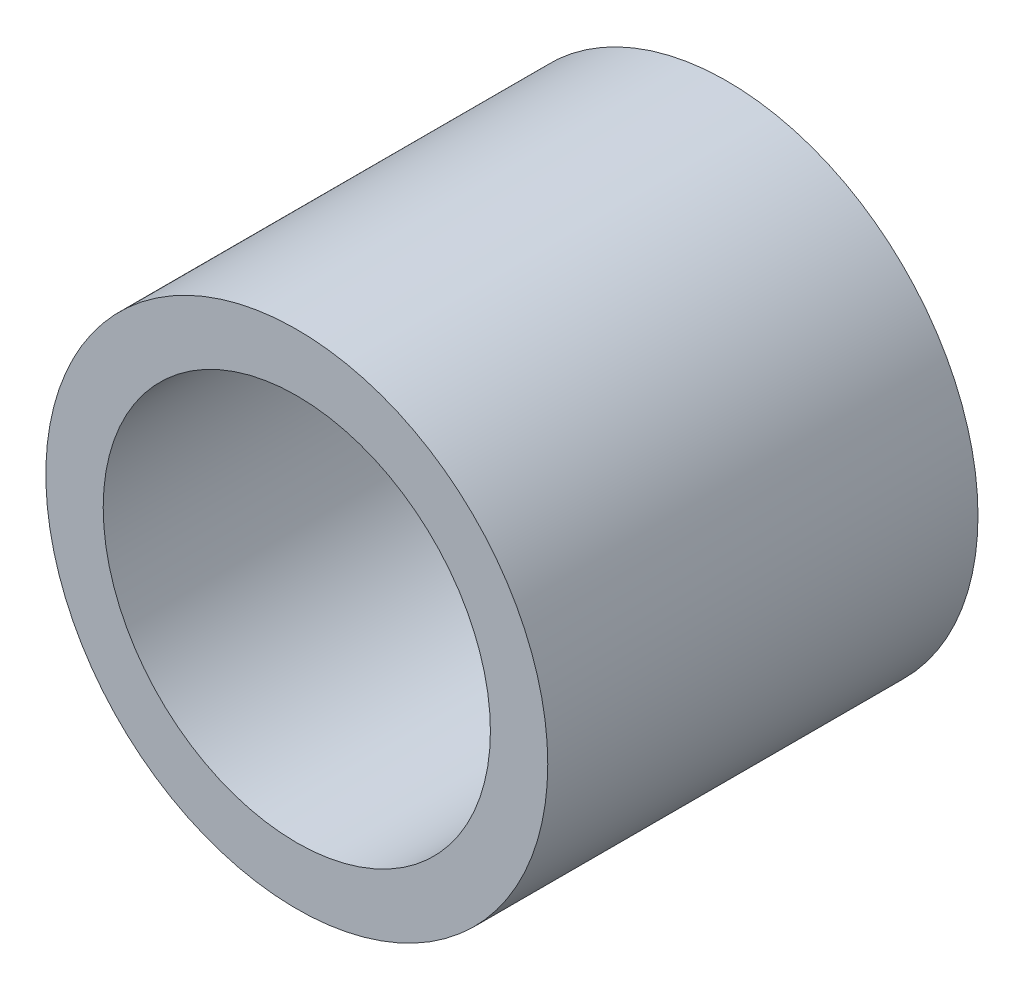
from build123d import *

# Parameters (mm, degrees)
ESQUISSE1_R             = 17.5
BASE_EXTRUSION_DEPTH    = 30
ESQUISSE2_R             = 13.5
ENL_V_MAT_EXTRU_1_DEPTH = 30


with BuildPart() as part:
    # Esquisse1 → Base-Extrusion (new body)
    with BuildSketch(Plane.XY):
        Circle(ESQUISSE1_R)
    extrude(amount=BASE_EXTRUSION_DEPTH)

    # Esquisse2 → Enl_v. mat.-Extru.1 (cut)
    with BuildSketch(Plane.XY.offset(30)):
        Circle(ESQUISSE2_R)
    extrude(amount=-ENL_V_MAT_EXTRU_1_DEPTH, mode=Mode.SUBTRACT)


solid = part.part
